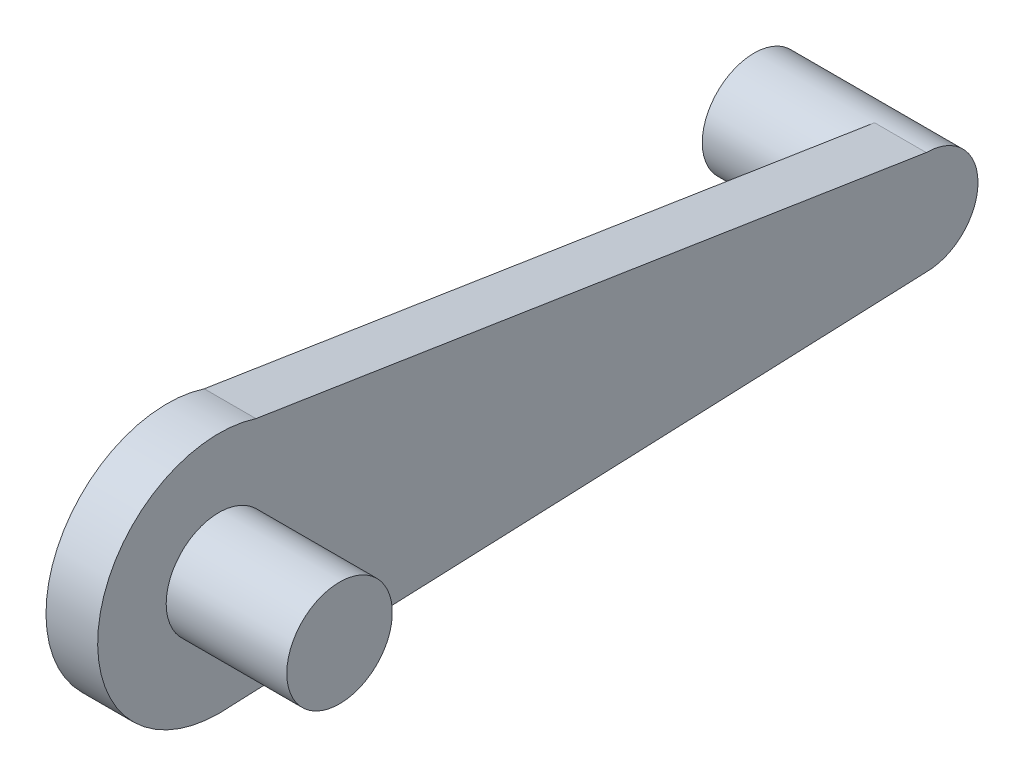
ISO-10303-21;
HEADER;
FILE_DESCRIPTION(('STEP AP214'),'2;1');
FILE_NAME('part.step','',(''),(''),'','','');
FILE_SCHEMA(('AUTOMOTIVE_DESIGN { 1 0 10303 214 1 1 1 1 }'));
ENDSEC;
DATA;
#1=APPLICATION_CONTEXT('core data for automotive mechanical design processes');
#2=APPLICATION_PROTOCOL_DEFINITION('international standard','automotive_design',2000,#1);
#3=PRODUCT_CONTEXT('',#1,'mechanical');
#4=PRODUCT('Part','Part','',(#3));
#5=PRODUCT_RELATED_PRODUCT_CATEGORY('part','',(#4));
#6=PRODUCT_DEFINITION_FORMATION('','',#4);
#7=PRODUCT_DEFINITION_CONTEXT('part definition',#1,'design');
#8=PRODUCT_DEFINITION('design','',#6,#7);
#9=PRODUCT_DEFINITION_SHAPE('','',#8);
#10=(LENGTH_UNIT() NAMED_UNIT(*) SI_UNIT(.MILLI.,.METRE.));
#11=(NAMED_UNIT(*) PLANE_ANGLE_UNIT() SI_UNIT($,.RADIAN.));
#12=(NAMED_UNIT(*) SI_UNIT($,.STERADIAN.) SOLID_ANGLE_UNIT());
#13=UNCERTAINTY_MEASURE_WITH_UNIT(LENGTH_MEASURE(1.E-05),#10,'distance_accuracy_value','');
#14=(GEOMETRIC_REPRESENTATION_CONTEXT(3) GLOBAL_UNCERTAINTY_ASSIGNED_CONTEXT((#13)) GLOBAL_UNIT_ASSIGNED_CONTEXT((#10,
#11,#12)) REPRESENTATION_CONTEXT('',''));
#15=CARTESIAN_POINT('',(0.,0.,0.));
#16=DIRECTION('',(0.,0.,1.));
#17=DIRECTION('',(1.,0.,0.));
#18=AXIS2_PLACEMENT_3D('',#15,#16,#17);
#19=CARTESIAN_POINT('',(-14.3547420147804,4.34444392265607,-122.437605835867));
#20=DIRECTION('',(1.,0.,0.));
#21=DIRECTION('',(0.,0.,-1.));
#22=AXIS2_PLACEMENT_3D('',#19,#20,#21);
#23=CYLINDRICAL_SURFACE('',#22,11.60306699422);
#24=CARTESIAN_POINT('',(-14.3547420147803,4.34444392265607,-122.437605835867));
#25=DIRECTION('',(-1.,0.,0.));
#26=DIRECTION('',(0.,0.,1.));
#27=AXIS2_PLACEMENT_3D('',#24,#25,#26);
#28=CIRCLE('',#27,11.60306699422);
#29=CARTESIAN_POINT('',(-14.3547420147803,-7.25862307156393,-122.437605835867));
#30=VERTEX_POINT('',#29);
#31=CARTESIAN_POINT('',(-14.3547420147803,15.9475109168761,-122.437605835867));
#32=VERTEX_POINT('',#31);
#33=EDGE_CURVE('E11',#30,#32,#28,.T.);
#34=ORIENTED_EDGE('',*,*,#33,.T.);
#35=DIRECTION('',(-1.,0.,0.));
#36=VECTOR('',#35,1.);
#37=CARTESIAN_POINT('',(-2.76506131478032,15.9475109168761,-122.437605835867));
#38=LINE('',#37,#36);
#39=CARTESIAN_POINT('',(-2.76506131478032,15.9475109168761,-122.437605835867));
#40=VERTEX_POINT('',#39);
#41=EDGE_CURVE('E90',#40,#32,#38,.T.);
#42=ORIENTED_EDGE('',*,*,#41,.F.);
#43=CARTESIAN_POINT('',(-2.76506131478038,4.34444392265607,-122.437605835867));
#44=DIRECTION('',(-1.,0.,0.));
#45=DIRECTION('',(0.,0.,1.));
#46=AXIS2_PLACEMENT_3D('',#43,#44,#45);
#47=CIRCLE('',#46,11.60306699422);
#48=CARTESIAN_POINT('',(-2.76506131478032,-7.25862307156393,-122.437605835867));
#49=VERTEX_POINT('',#48);
#50=EDGE_CURVE('E46',#40,#49,#47,.T.);
#51=ORIENTED_EDGE('',*,*,#50,.T.);
#52=DIRECTION('',(-1.,0.,0.));
#53=VECTOR('',#52,1.);
#54=CARTESIAN_POINT('',(-2.76506131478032,-7.25862307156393,-122.437605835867));
#55=LINE('',#54,#53);
#56=EDGE_CURVE('E100',#49,#30,#55,.T.);
#57=ORIENTED_EDGE('',*,*,#56,.T.);
#58=EDGE_LOOP('',(#34,#42,#51,#57));
#59=FACE_BOUND('',#58,.T.);
#60=CARTESIAN_POINT('',(-41.3973303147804,4.34444392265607,-122.437605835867));
#61=DIRECTION('',(-1.,0.,0.));
#62=DIRECTION('',(0.,0.,1.));
#63=AXIS2_PLACEMENT_3D('',#60,#61,#62);
#64=CIRCLE('',#63,11.60306699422);
#65=CARTESIAN_POINT('',(-41.3973303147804,4.34444392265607,-110.834538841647));
#66=VERTEX_POINT('',#65);
#67=EDGE_CURVE('E105',#66,#66,#64,.T.);
#68=ORIENTED_EDGE('',*,*,#67,.F.);
#69=EDGE_LOOP('',(#68));
#70=FACE_BOUND('',#69,.T.);
#71=ADVANCED_FACE('F37',(#59,#70),#23,.T.);
#72=CARTESIAN_POINT('',(-2.76506131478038,4.34444392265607,-122.437605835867));
#73=DIRECTION('',(-1.,0.,0.));
#74=DIRECTION('',(0.,0.,1.));
#75=AXIS2_PLACEMENT_3D('',#72,#73,#74);
#76=PLANE('',#75);
#77=ORIENTED_EDGE('',*,*,#50,.F.);
#78=DIRECTION('',(0.,-0.154368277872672,-0.988013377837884));
#79=VECTOR('',#78,1.);
#80=CARTESIAN_POINT('',(-2.76506131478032,40.7312892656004,36.1876305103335));
#81=LINE('',#80,#79);
#82=CARTESIAN_POINT('',(-2.76506131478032,39.434813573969,27.8897124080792));
#83=VERTEX_POINT('',#82);
#84=EDGE_CURVE('E87',#83,#40,#81,.T.);
#85=ORIENTED_EDGE('',*,*,#84,.F.);
#86=CARTESIAN_POINT('',(-2.76506131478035,13.5281976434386,36.1876305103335));
#87=DIRECTION('',(-1.,0.,0.));
#88=DIRECTION('',(0.,0.,1.));
#89=AXIS2_PLACEMENT_3D('',#86,#87,#88);
#90=CIRCLE('',#89,27.2030916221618);
#91=CARTESIAN_POINT('',(-2.76506131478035,-13.6748939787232,36.1876305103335));
#92=VERTEX_POINT('',#91);
#93=EDGE_CURVE('E62',#92,#83,#90,.T.);
#94=ORIENTED_EDGE('',*,*,#93,.F.);
#95=CARTESIAN_POINT('',(-2.76506131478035,13.5281976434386,36.1876305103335));
#96=DIRECTION('',(-1.,0.,0.));
#97=DIRECTION('',(0.,-0.996733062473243,-0.0807663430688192));
#98=AXIS2_PLACEMENT_3D('',#95,#96,#97);
#99=CIRCLE('',#98,27.2030916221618);
#100=CARTESIAN_POINT('',(-2.76506131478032,-13.586023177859,33.9905362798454));
#101=VERTEX_POINT('',#100);
#102=EDGE_CURVE('E108',#101,#92,#99,.T.);
#103=ORIENTED_EDGE('',*,*,#102,.F.);
#104=DIRECTION('',(0.,-0.0404161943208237,0.999182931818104));
#105=VECTOR('',#104,1.);
#106=CARTESIAN_POINT('',(-2.76506131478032,-7.25862307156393,-122.437605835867));
#107=LINE('',#106,#105);
#108=EDGE_CURVE('E94',#49,#101,#107,.T.);
#109=ORIENTED_EDGE('',*,*,#108,.F.);
#110=EDGE_LOOP('',(#77,#85,#94,#103,#109));
#111=FACE_BOUND('',#110,.T.);
#112=CARTESIAN_POINT('',(-2.76506131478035,13.5281976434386,36.1876305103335));
#113=DIRECTION('',(-1.,0.,0.));
#114=DIRECTION('',(0.,0.,1.));
#115=AXIS2_PLACEMENT_3D('',#112,#113,#114);
#116=CIRCLE('',#115,11.8355202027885);
#117=CARTESIAN_POINT('',(-2.76506131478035,13.5281976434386,48.023150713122));
#118=VERTEX_POINT('',#117);
#119=EDGE_CURVE('E180',#118,#118,#116,.T.);
#120=ORIENTED_EDGE('',*,*,#119,.T.);
#121=EDGE_LOOP('',(#120));
#122=FACE_BOUND('',#121,.T.);
#123=ADVANCED_FACE('F103',(#111,#122),#76,.F.);
#124=CARTESIAN_POINT('',(-41.3973303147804,4.34444392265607,-122.437605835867));
#125=DIRECTION('',(-1.,0.,0.));
#126=DIRECTION('',(0.,0.,1.));
#127=AXIS2_PLACEMENT_3D('',#124,#125,#126);
#128=PLANE('',#127);
#129=ORIENTED_EDGE('',*,*,#67,.T.);
#130=EDGE_LOOP('',(#129));
#131=FACE_BOUND('',#130,.T.);
#132=ADVANCED_FACE('F196',(#131),#128,.T.);
#133=CARTESIAN_POINT('',(-14.3547420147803,13.5281976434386,36.1876305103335));
#134=DIRECTION('',(-1.,0.,0.));
#135=DIRECTION('',(0.,0.,1.));
#136=AXIS2_PLACEMENT_3D('',#133,#134,#135);
#137=PLANE('',#136);
#138=ORIENTED_EDGE('',*,*,#33,.F.);
#139=DIRECTION('',(0.,-0.0404161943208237,0.999182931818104));
#140=VECTOR('',#139,1.);
#141=CARTESIAN_POINT('',(-14.3547420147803,-7.25862307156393,-122.437605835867));
#142=LINE('',#141,#140);
#143=CARTESIAN_POINT('',(-14.3547420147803,-13.586023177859,33.9905362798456));
#144=VERTEX_POINT('',#143);
#145=EDGE_CURVE('E54',#30,#144,#142,.T.);
#146=ORIENTED_EDGE('',*,*,#145,.T.);
#147=CARTESIAN_POINT('',(-14.3547420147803,-13.586023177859,33.9905362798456));
#148=DIRECTION('',(0.,-0.0404161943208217,0.999182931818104));
#149=VECTOR('',#148,1.);
#150=LINE('',#147,#149);
#151=CARTESIAN_POINT('',(-14.3547420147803,-13.6748939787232,36.1876305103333));
#152=VERTEX_POINT('',#151);
#153=EDGE_CURVE('E114',#144,#152,#150,.T.);
#154=ORIENTED_EDGE('',*,*,#153,.T.);
#155=CARTESIAN_POINT('',(-14.3547420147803,13.5281976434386,36.1876305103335));
#156=DIRECTION('',(-1.,0.,0.));
#157=DIRECTION('',(0.,0.,1.));
#158=AXIS2_PLACEMENT_3D('',#155,#156,#157);
#159=CIRCLE('',#158,27.2030916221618);
#160=CARTESIAN_POINT('',(-14.3547420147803,39.434813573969,27.8897124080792));
#161=VERTEX_POINT('',#160);
#162=EDGE_CURVE('E121',#152,#161,#159,.T.);
#163=ORIENTED_EDGE('',*,*,#162,.T.);
#164=DIRECTION('',(0.,-0.154368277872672,-0.988013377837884));
#165=VECTOR('',#164,1.);
#166=CARTESIAN_POINT('',(-14.3547420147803,40.7312892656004,36.1876305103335));
#167=LINE('',#166,#165);
#168=EDGE_CURVE('E127',#161,#32,#167,.T.);
#169=ORIENTED_EDGE('',*,*,#168,.T.);
#170=EDGE_LOOP('',(#138,#146,#154,#163,#169));
#171=FACE_BOUND('',#170,.T.);
#172=ADVANCED_FACE('F156',(#171),#137,.T.);
#173=CARTESIAN_POINT('',(-2.76506131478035,13.5281976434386,36.1876305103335));
#174=DIRECTION('',(1.,0.,0.));
#175=DIRECTION('',(0.,0.,-1.));
#176=AXIS2_PLACEMENT_3D('',#173,#174,#175);
#177=CYLINDRICAL_SURFACE('',#176,11.8355202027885);
#178=ORIENTED_EDGE('',*,*,#119,.F.);
#179=EDGE_LOOP('',(#178));
#180=FACE_BOUND('',#179,.T.);
#181=CARTESIAN_POINT('',(24.2775269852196,13.5281976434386,36.1876305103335));
#182=DIRECTION('',(-1.,0.,0.));
#183=DIRECTION('',(0.,0.,1.));
#184=AXIS2_PLACEMENT_3D('',#181,#182,#183);
#185=CIRCLE('',#184,11.8355202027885);
#186=CARTESIAN_POINT('',(24.2775269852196,13.5281976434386,48.023150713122));
#187=VERTEX_POINT('',#186);
#188=EDGE_CURVE('E140',#187,#187,#185,.T.);
#189=ORIENTED_EDGE('',*,*,#188,.T.);
#190=EDGE_LOOP('',(#189));
#191=FACE_BOUND('',#190,.T.);
#192=ADVANCED_FACE('F184',(#180,#191),#177,.T.);
#193=CARTESIAN_POINT('',(24.2775269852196,13.5281976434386,36.1876305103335));
#194=DIRECTION('',(-1.,0.,0.));
#195=DIRECTION('',(0.,0.,1.));
#196=AXIS2_PLACEMENT_3D('',#193,#194,#195);
#197=PLANE('',#196);
#198=ORIENTED_EDGE('',*,*,#188,.F.);
#199=EDGE_LOOP('',(#198));
#200=FACE_BOUND('',#199,.T.);
#201=ADVANCED_FACE('F155',(#200),#197,.F.);
#202=CARTESIAN_POINT('',(-14.3547420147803,13.5281976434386,36.1876305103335));
#203=DIRECTION('',(1.,0.,0.));
#204=DIRECTION('',(0.,0.,-1.));
#205=AXIS2_PLACEMENT_3D('',#202,#203,#204);
#206=CYLINDRICAL_SURFACE('',#205,27.2030916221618);
#207=ORIENTED_EDGE('',*,*,#162,.F.);
#208=ORIENTED_EDGE('',*,*,#153,.F.);
#209=DIRECTION('',(1.,0.,0.));
#210=VECTOR('',#209,1.);
#211=CARTESIAN_POINT('',(-14.3547420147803,-13.5860231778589,33.9905362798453));
#212=LINE('',#211,#210);
#213=EDGE_CURVE('E116',#144,#101,#212,.T.);
#214=ORIENTED_EDGE('',*,*,#213,.T.);
#215=ORIENTED_EDGE('',*,*,#102,.T.);
#216=ORIENTED_EDGE('',*,*,#93,.T.);
#217=DIRECTION('',(1.,0.,0.));
#218=VECTOR('',#217,1.);
#219=CARTESIAN_POINT('',(-14.3547420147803,39.434813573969,27.8897124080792));
#220=LINE('',#219,#218);
#221=EDGE_CURVE('E92',#83,#161,#220,.F.);
#222=ORIENTED_EDGE('',*,*,#221,.T.);
#223=EDGE_LOOP('',(#207,#208,#214,#215,#216,#222));
#224=FACE_BOUND('',#223,.T.);
#225=ADVANCED_FACE('F117',(#224),#206,.T.);
#226=CARTESIAN_POINT('',(-2.76506131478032,-7.25862307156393,-122.437605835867));
#227=DIRECTION('',(0.,-0.999182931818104,-0.0404161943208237));
#228=DIRECTION('',(0.,0.0404161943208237,-0.999182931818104));
#229=AXIS2_PLACEMENT_3D('',#226,#227,#228);
#230=PLANE('',#229);
#231=ORIENTED_EDGE('',*,*,#213,.F.);
#232=ORIENTED_EDGE('',*,*,#145,.F.);
#233=ORIENTED_EDGE('',*,*,#56,.F.);
#234=ORIENTED_EDGE('',*,*,#108,.T.);
#235=EDGE_LOOP('',(#231,#232,#233,#234));
#236=FACE_BOUND('',#235,.T.);
#237=ADVANCED_FACE('F154',(#236),#230,.T.);
#238=CARTESIAN_POINT('',(-2.76506131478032,40.7312892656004,36.1876305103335));
#239=DIRECTION('',(0.,0.988013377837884,-0.154368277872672));
#240=DIRECTION('',(0.,0.154368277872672,0.988013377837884));
#241=AXIS2_PLACEMENT_3D('',#238,#239,#240);
#242=PLANE('',#241);
#243=ORIENTED_EDGE('',*,*,#221,.F.);
#244=ORIENTED_EDGE('',*,*,#84,.T.);
#245=ORIENTED_EDGE('',*,*,#41,.T.);
#246=ORIENTED_EDGE('',*,*,#168,.F.);
#247=EDGE_LOOP('',(#243,#244,#245,#246));
#248=FACE_BOUND('',#247,.T.);
#249=ADVANCED_FACE('F89',(#248),#242,.T.);
#250=CLOSED_SHELL('',(#71,#123,#132,#172,#192,#201,#225,#237,#249));
#251=MANIFOLD_SOLID_BREP('B2',#250);
#252=ADVANCED_BREP_SHAPE_REPRESENTATION('',(#18,#251),#14);
#253=SHAPE_DEFINITION_REPRESENTATION(#9,#252);
ENDSEC;
END-ISO-10303-21;
